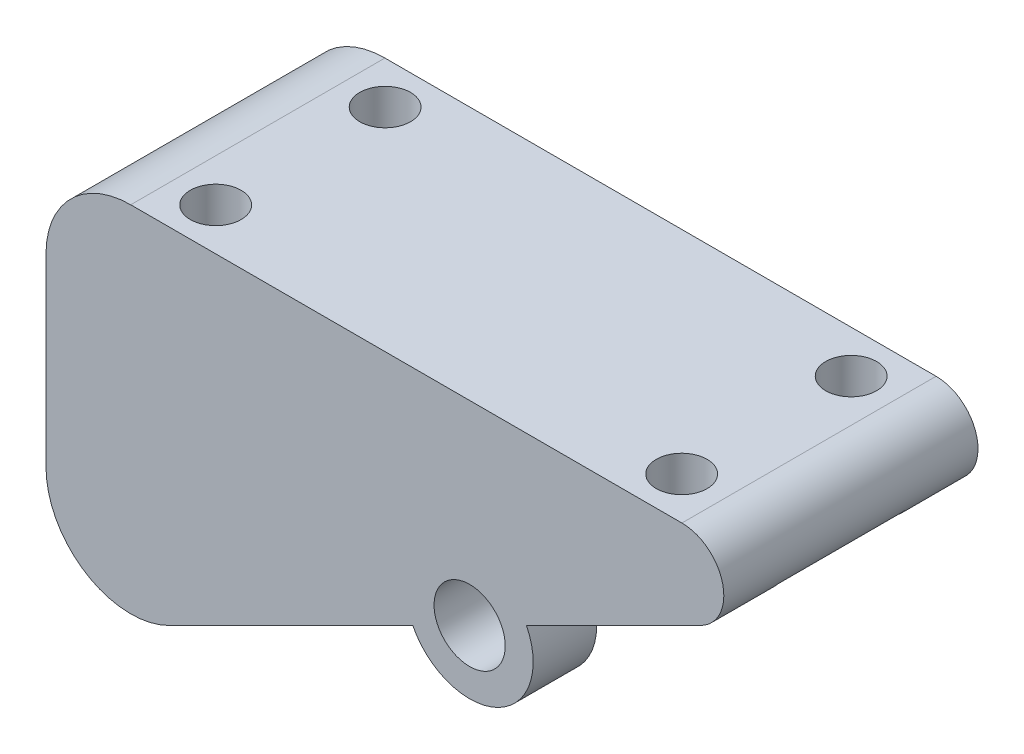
ISO-10303-21;
HEADER;
FILE_DESCRIPTION(('STEP AP214'),'2;1');
FILE_NAME('part.step','',(''),(''),'','','');
FILE_SCHEMA(('AUTOMOTIVE_DESIGN { 1 0 10303 214 1 1 1 1 }'));
ENDSEC;
DATA;
#1=APPLICATION_CONTEXT('core data for automotive mechanical design processes');
#2=APPLICATION_PROTOCOL_DEFINITION('international standard','automotive_design',2000,#1);
#3=PRODUCT_CONTEXT('',#1,'mechanical');
#4=PRODUCT('Part','Part','',(#3));
#5=PRODUCT_RELATED_PRODUCT_CATEGORY('part','',(#4));
#6=PRODUCT_DEFINITION_FORMATION('','',#4);
#7=PRODUCT_DEFINITION_CONTEXT('part definition',#1,'design');
#8=PRODUCT_DEFINITION('design','',#6,#7);
#9=PRODUCT_DEFINITION_SHAPE('','',#8);
#10=(LENGTH_UNIT() NAMED_UNIT(*) SI_UNIT(.MILLI.,.METRE.));
#11=(NAMED_UNIT(*) PLANE_ANGLE_UNIT() SI_UNIT($,.RADIAN.));
#12=(NAMED_UNIT(*) SI_UNIT($,.STERADIAN.) SOLID_ANGLE_UNIT());
#13=UNCERTAINTY_MEASURE_WITH_UNIT(LENGTH_MEASURE(1.E-05),#10,'distance_accuracy_value','');
#14=(GEOMETRIC_REPRESENTATION_CONTEXT(3) GLOBAL_UNCERTAINTY_ASSIGNED_CONTEXT((#13)) GLOBAL_UNIT_ASSIGNED_CONTEXT((#10,
#11,#12)) REPRESENTATION_CONTEXT('',''));
#15=CARTESIAN_POINT('',(0.,0.,0.));
#16=DIRECTION('',(0.,0.,1.));
#17=DIRECTION('',(1.,0.,0.));
#18=AXIS2_PLACEMENT_3D('',#15,#16,#17);
#19=CARTESIAN_POINT('',(-50.,0.,8.));
#20=DIRECTION('',(1.,0.,0.));
#21=DIRECTION('',(0.,1.,0.));
#22=AXIS2_PLACEMENT_3D('',#19,#20,#21);
#23=PLANE('',#22);
#24=DIRECTION('',(0.,-1.,0.));
#25=VECTOR('',#24,1.);
#26=CARTESIAN_POINT('',(-50.,13.0000000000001,-14.5));
#27=LINE('',#26,#25);
#28=CARTESIAN_POINT('',(-50.,13.0000000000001,-14.5));
#29=VERTEX_POINT('',#28);
#30=CARTESIAN_POINT('',(-50.,-8.819660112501,-14.5));
#31=VERTEX_POINT('',#30);
#32=EDGE_CURVE('E67',#29,#31,#27,.T.);
#33=ORIENTED_EDGE('',*,*,#32,.F.);
#34=DIRECTION('',(0.,0.,1.));
#35=VECTOR('',#34,1.);
#36=CARTESIAN_POINT('',(-50.,13.0000000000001,-22.));
#37=LINE('',#36,#35);
#38=CARTESIAN_POINT('',(-50.,13.0000000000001,-22.));
#39=VERTEX_POINT('',#38);
#40=EDGE_CURVE('E177',#29,#39,#37,.F.);
#41=ORIENTED_EDGE('',*,*,#40,.T.);
#42=DIRECTION('',(0.,-1.,0.));
#43=VECTOR('',#42,1.);
#44=CARTESIAN_POINT('',(-50.,23.0000000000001,-22.));
#45=LINE('',#44,#43);
#46=CARTESIAN_POINT('',(-50.,-8.819660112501,-22.));
#47=VERTEX_POINT('',#46);
#48=EDGE_CURVE('E233',#39,#47,#45,.T.);
#49=ORIENTED_EDGE('',*,*,#48,.T.);
#50=DIRECTION('',(0.,0.,1.));
#51=VECTOR('',#50,1.);
#52=CARTESIAN_POINT('',(-50.,-8.819660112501,8.));
#53=LINE('',#52,#51);
#54=EDGE_CURVE('E187',#47,#31,#53,.T.);
#55=ORIENTED_EDGE('',*,*,#54,.T.);
#56=EDGE_LOOP('',(#33,#41,#49,#55));
#57=FACE_BOUND('',#56,.T.);
#58=ADVANCED_FACE('F43',(#57),#23,.F.);
#59=CARTESIAN_POINT('',(0.,0.,-22.));
#60=DIRECTION('',(0.,0.,1.));
#61=DIRECTION('',(1.,0.,0.));
#62=AXIS2_PLACEMENT_3D('',#59,#60,#61);
#63=CYLINDRICAL_SURFACE('',#62,7.5);
#64=CARTESIAN_POINT('',(0.,0.,-14.5));
#65=DIRECTION('',(0.,0.,1.));
#66=DIRECTION('',(1.,0.,0.));
#67=AXIS2_PLACEMENT_3D('',#64,#65,#66);
#68=CIRCLE('',#67,7.5);
#69=CARTESIAN_POINT('',(-6.70820393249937,-3.35410196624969,-14.5));
#70=VERTEX_POINT('',#69);
#71=CARTESIAN_POINT('',(6.70820393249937,3.35410196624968,-14.5));
#72=VERTEX_POINT('',#71);
#73=EDGE_CURVE('E323',#70,#72,#68,.T.);
#74=ORIENTED_EDGE('',*,*,#73,.F.);
#75=DIRECTION('',(0.,0.,1.));
#76=VECTOR('',#75,1.);
#77=CARTESIAN_POINT('',(-6.70820393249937,-3.35410196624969,-22.));
#78=LINE('',#77,#76);
#79=CARTESIAN_POINT('',(-6.70820393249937,-3.35410196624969,-22.));
#80=VERTEX_POINT('',#79);
#81=EDGE_CURVE('E231',#80,#70,#78,.T.);
#82=ORIENTED_EDGE('',*,*,#81,.F.);
#83=CARTESIAN_POINT('',(0.,0.,-22.));
#84=DIRECTION('',(0.,0.,-1.));
#85=DIRECTION('',(-1.,0.,0.));
#86=AXIS2_PLACEMENT_3D('',#83,#84,#85);
#87=CIRCLE('',#86,7.5);
#88=CARTESIAN_POINT('',(6.70820393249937,3.35410196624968,-22.));
#89=VERTEX_POINT('',#88);
#90=EDGE_CURVE('E310',#89,#80,#87,.T.);
#91=ORIENTED_EDGE('',*,*,#90,.F.);
#92=DIRECTION('',(0.,0.,1.));
#93=VECTOR('',#92,1.);
#94=CARTESIAN_POINT('',(6.70820393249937,3.35410196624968,-22.));
#95=LINE('',#94,#93);
#96=EDGE_CURVE('E236',#89,#72,#95,.T.);
#97=ORIENTED_EDGE('',*,*,#96,.T.);
#98=EDGE_LOOP('',(#74,#82,#91,#97));
#99=FACE_BOUND('',#98,.T.);
#100=ADVANCED_FACE('F321',(#99),#63,.T.);
#101=CARTESIAN_POINT('',(-6.70820393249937,-3.35410196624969,-22.));
#102=DIRECTION('',(-0.447213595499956,0.894427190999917,0.));
#103=DIRECTION('',(-0.894427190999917,-0.447213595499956,0.));
#104=AXIS2_PLACEMENT_3D('',#101,#102,#103);
#105=PLANE('',#104);
#106=DIRECTION('',(0.894427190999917,0.447213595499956,0.));
#107=VECTOR('',#106,1.);
#108=CARTESIAN_POINT('',(-35.5278640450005,-17.7639320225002,-14.5));
#109=LINE('',#108,#107);
#110=CARTESIAN_POINT('',(-35.5278640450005,-17.7639320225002,-14.5));
#111=VERTEX_POINT('',#110);
#112=EDGE_CURVE('E273',#111,#70,#109,.T.);
#113=ORIENTED_EDGE('',*,*,#112,.F.);
#114=DIRECTION('',(0.,0.,1.));
#115=VECTOR('',#114,1.);
#116=CARTESIAN_POINT('',(-35.5278640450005,-17.7639320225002,-22.));
#117=LINE('',#116,#115);
#118=CARTESIAN_POINT('',(-35.5278640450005,-17.7639320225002,-22.));
#119=VERTEX_POINT('',#118);
#120=EDGE_CURVE('E190',#111,#119,#117,.F.);
#121=ORIENTED_EDGE('',*,*,#120,.T.);
#122=DIRECTION('',(-0.894427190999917,-0.447213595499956,0.));
#123=VECTOR('',#122,1.);
#124=CARTESIAN_POINT('',(-6.70820393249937,-3.35410196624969,-22.));
#125=LINE('',#124,#123);
#126=EDGE_CURVE('E313',#80,#119,#125,.T.);
#127=ORIENTED_EDGE('',*,*,#126,.F.);
#128=ORIENTED_EDGE('',*,*,#81,.T.);
#129=EDGE_LOOP('',(#113,#121,#127,#128));
#130=FACE_BOUND('',#129,.T.);
#131=ADVANCED_FACE('F386',(#130),#105,.F.);
#132=CARTESIAN_POINT('',(30.,15.0000000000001,-22.));
#133=DIRECTION('',(-0.447213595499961,0.894427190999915,0.));
#134=DIRECTION('',(-0.894427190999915,-0.447213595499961,0.));
#135=AXIS2_PLACEMENT_3D('',#132,#133,#134);
#136=PLANE('',#135);
#137=DIRECTION('',(0.894427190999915,0.447213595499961,0.));
#138=VECTOR('',#137,1.);
#139=CARTESIAN_POINT('',(6.70820393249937,3.35410196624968,-14.5));
#140=LINE('',#139,#138);
#141=CARTESIAN_POINT('',(27.266873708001,13.6334368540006,-14.5));
#142=VERTEX_POINT('',#141);
#143=EDGE_CURVE('E328',#72,#142,#140,.T.);
#144=ORIENTED_EDGE('',*,*,#143,.F.);
#145=ORIENTED_EDGE('',*,*,#96,.F.);
#146=DIRECTION('',(-0.894427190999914,-0.447213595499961,0.));
#147=VECTOR('',#146,1.);
#148=CARTESIAN_POINT('',(30.,15.0000000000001,-22.));
#149=LINE('',#148,#147);
#150=CARTESIAN_POINT('',(27.266873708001,13.6334368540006,-22.));
#151=VERTEX_POINT('',#150);
#152=EDGE_CURVE('E315',#151,#89,#149,.T.);
#153=ORIENTED_EDGE('',*,*,#152,.F.);
#154=DIRECTION('',(0.,0.,-1.));
#155=VECTOR('',#154,1.);
#156=CARTESIAN_POINT('',(27.266873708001,13.6334368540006,-22.));
#157=LINE('',#156,#155);
#158=EDGE_CURVE('E204',#151,#142,#157,.F.);
#159=ORIENTED_EDGE('',*,*,#158,.T.);
#160=EDGE_LOOP('',(#144,#145,#153,#159));
#161=FACE_BOUND('',#160,.T.);
#162=ADVANCED_FACE('F327',(#161),#136,.F.);
#163=CARTESIAN_POINT('',(0.,0.,-22.));
#164=DIRECTION('',(0.,0.,1.));
#165=DIRECTION('',(1.,0.,0.));
#166=AXIS2_PLACEMENT_3D('',#163,#164,#165);
#167=CYLINDRICAL_SURFACE('',#166,4.2);
#168=CARTESIAN_POINT('',(0.,0.,-22.));
#169=DIRECTION('',(0.,0.,-1.));
#170=DIRECTION('',(-1.,0.,0.));
#171=AXIS2_PLACEMENT_3D('',#168,#169,#170);
#172=CIRCLE('',#171,4.2);
#173=CARTESIAN_POINT('',(-4.2,0.,-22.));
#174=VERTEX_POINT('',#173);
#175=EDGE_CURVE('E305',#174,#174,#172,.T.);
#176=ORIENTED_EDGE('',*,*,#175,.T.);
#177=EDGE_LOOP('',(#176));
#178=FACE_BOUND('',#177,.T.);
#179=CARTESIAN_POINT('',(0.,0.,-14.5));
#180=DIRECTION('',(0.,0.,1.));
#181=DIRECTION('',(1.,0.,0.));
#182=AXIS2_PLACEMENT_3D('',#179,#180,#181);
#183=CIRCLE('',#182,4.2);
#184=CARTESIAN_POINT('',(4.2,0.,-14.5));
#185=VERTEX_POINT('',#184);
#186=EDGE_CURVE('E275',#185,#185,#183,.T.);
#187=ORIENTED_EDGE('',*,*,#186,.T.);
#188=EDGE_LOOP('',(#187));
#189=FACE_BOUND('',#188,.T.);
#190=ADVANCED_FACE('F399',(#178,#189),#167,.F.);
#191=CARTESIAN_POINT('',(-40.,-8.819660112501,8.));
#192=DIRECTION('',(0.,0.,1.));
#193=DIRECTION('',(1.,0.,0.));
#194=AXIS2_PLACEMENT_3D('',#191,#192,#193);
#195=CYLINDRICAL_SURFACE('',#194,10.);
#196=ORIENTED_EDGE('',*,*,#120,.F.);
#197=CARTESIAN_POINT('',(-40.,-8.819660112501,-14.5));
#198=DIRECTION('',(0.,0.,1.));
#199=DIRECTION('',(1.,0.,0.));
#200=AXIS2_PLACEMENT_3D('',#197,#198,#199);
#201=CIRCLE('',#200,10.);
#202=EDGE_CURVE('E271',#31,#111,#201,.T.);
#203=ORIENTED_EDGE('',*,*,#202,.F.);
#204=ORIENTED_EDGE('',*,*,#54,.F.);
#205=CARTESIAN_POINT('',(-40.,-8.819660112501,-22.));
#206=DIRECTION('',(0.,0.,1.));
#207=DIRECTION('',(1.,0.,0.));
#208=AXIS2_PLACEMENT_3D('',#205,#206,#207);
#209=CIRCLE('',#208,10.);
#210=EDGE_CURVE('E192',#119,#47,#209,.F.);
#211=ORIENTED_EDGE('',*,*,#210,.F.);
#212=EDGE_LOOP('',(#196,#203,#204,#211));
#213=FACE_BOUND('',#212,.T.);
#214=ADVANCED_FACE('F270',(#213),#195,.T.);
#215=CARTESIAN_POINT('',(25.0557280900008,18.0557280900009,8.));
#216=DIRECTION('',(0.,0.,-1.));
#217=DIRECTION('',(-1.,0.,0.));
#218=AXIS2_PLACEMENT_3D('',#215,#216,#217);
#219=CYLINDRICAL_SURFACE('',#218,4.94427190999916);
#220=CARTESIAN_POINT('',(25.0557280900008,18.0557280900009,0.5));
#221=DIRECTION('',(0.,0.,1.));
#222=DIRECTION('',(1.,0.,0.));
#223=AXIS2_PLACEMENT_3D('',#220,#221,#222);
#224=CIRCLE('',#223,4.94427190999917);
#225=CARTESIAN_POINT('',(27.266873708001,13.6334368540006,0.5));
#226=VERTEX_POINT('',#225);
#227=CARTESIAN_POINT('',(28.942674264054,15.0000000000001,0.5));
#228=VERTEX_POINT('',#227);
#229=EDGE_CURVE('E345',#226,#228,#224,.T.);
#230=ORIENTED_EDGE('',*,*,#229,.T.);
#231=DIRECTION('',(0.,0.,-1.));
#232=VECTOR('',#231,1.);
#233=CARTESIAN_POINT('',(28.942674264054,15.0000000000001,8.));
#234=LINE('',#233,#232);
#235=CARTESIAN_POINT('',(28.942674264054,15.0000000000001,-14.5));
#236=VERTEX_POINT('',#235);
#237=EDGE_CURVE('E207',#236,#228,#234,.F.);
#238=ORIENTED_EDGE('',*,*,#237,.F.);
#239=CARTESIAN_POINT('',(25.0557280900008,18.0557280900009,-14.5));
#240=DIRECTION('',(0.,0.,1.));
#241=DIRECTION('',(1.,0.,0.));
#242=AXIS2_PLACEMENT_3D('',#239,#240,#241);
#243=CIRCLE('',#242,4.94427190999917);
#244=EDGE_CURVE('E331',#142,#236,#243,.T.);
#245=ORIENTED_EDGE('',*,*,#244,.F.);
#246=ORIENTED_EDGE('',*,*,#158,.F.);
#247=CARTESIAN_POINT('',(25.0557280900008,18.0557280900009,-22.));
#248=DIRECTION('',(0.,0.,1.));
#249=DIRECTION('',(1.,0.,0.));
#250=AXIS2_PLACEMENT_3D('',#247,#248,#249);
#251=CIRCLE('',#250,4.94427190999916);
#252=CARTESIAN_POINT('',(25.0557280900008,23.0000000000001,-22.));
#253=VERTEX_POINT('',#252);
#254=EDGE_CURVE('E11',#253,#151,#251,.F.);
#255=ORIENTED_EDGE('',*,*,#254,.F.);
#256=DIRECTION('',(0.,0.,1.));
#257=VECTOR('',#256,1.);
#258=CARTESIAN_POINT('',(25.0557280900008,23.0000000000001,8.));
#259=LINE('',#258,#257);
#260=CARTESIAN_POINT('',(25.0557280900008,23.0000000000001,8.));
#261=VERTEX_POINT('',#260);
#262=EDGE_CURVE('E201',#261,#253,#259,.F.);
#263=ORIENTED_EDGE('',*,*,#262,.F.);
#264=CARTESIAN_POINT('',(25.0557280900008,18.0557280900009,8.));
#265=DIRECTION('',(0.,0.,1.));
#266=DIRECTION('',(1.,0.,0.));
#267=AXIS2_PLACEMENT_3D('',#264,#265,#266);
#268=CIRCLE('',#267,4.94427190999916);
#269=CARTESIAN_POINT('',(27.266873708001,13.6334368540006,8.));
#270=VERTEX_POINT('',#269);
#271=EDGE_CURVE('E52',#270,#261,#268,.T.);
#272=ORIENTED_EDGE('',*,*,#271,.F.);
#273=DIRECTION('',(0.,0.,-1.));
#274=VECTOR('',#273,1.);
#275=CARTESIAN_POINT('',(27.266873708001,13.6334368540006,8.));
#276=LINE('',#275,#274);
#277=EDGE_CURVE('E209',#226,#270,#276,.F.);
#278=ORIENTED_EDGE('',*,*,#277,.F.);
#279=EDGE_LOOP('',(#230,#238,#245,#246,#255,#263,#272,#278));
#280=FACE_BOUND('',#279,.T.);
#281=ADVANCED_FACE('F46',(#280),#219,.T.);
#282=DIRECTION('',(0.,0.,1.));
#283=VECTOR('',#282,1.);
#284=CARTESIAN_POINT('',(-50.,13.0000000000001,-22.));
#285=LINE('',#284,#283);
#286=CARTESIAN_POINT('',(-50.,13.0000000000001,8.));
#287=VERTEX_POINT('',#286);
#288=CARTESIAN_POINT('',(-50.,13.0000000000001,0.5));
#289=VERTEX_POINT('',#288);
#290=EDGE_CURVE('E169',#287,#289,#285,.F.);
#291=ORIENTED_EDGE('',*,*,#290,.T.);
#292=DIRECTION('',(0.,1.,0.));
#293=VECTOR('',#292,1.);
#294=CARTESIAN_POINT('',(-50.,0.,0.5));
#295=LINE('',#294,#293);
#296=CARTESIAN_POINT('',(-50.,-8.819660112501,0.5));
#297=VERTEX_POINT('',#296);
#298=EDGE_CURVE('E155',#297,#289,#295,.T.);
#299=ORIENTED_EDGE('',*,*,#298,.F.);
#300=DIRECTION('',(0.,0.,-1.));
#301=VECTOR('',#300,1.);
#302=CARTESIAN_POINT('',(-50.,-8.819660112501,8.));
#303=LINE('',#302,#301);
#304=CARTESIAN_POINT('',(-50.,-8.819660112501,8.));
#305=VERTEX_POINT('',#304);
#306=EDGE_CURVE('E197',#297,#305,#303,.F.);
#307=ORIENTED_EDGE('',*,*,#306,.T.);
#308=DIRECTION('',(0.,-1.,0.));
#309=VECTOR('',#308,1.);
#310=CARTESIAN_POINT('',(-50.,0.,8.));
#311=LINE('',#310,#309);
#312=EDGE_CURVE('E176',#287,#305,#311,.T.);
#313=ORIENTED_EDGE('',*,*,#312,.F.);
#314=EDGE_LOOP('',(#291,#299,#307,#313));
#315=FACE_BOUND('',#314,.T.);
#316=ADVANCED_FACE('F174',(#315),#23,.F.);
#317=CARTESIAN_POINT('',(0.,15.0000000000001,0.));
#318=DIRECTION('',(0.,1.,0.));
#319=DIRECTION('',(0.,0.,1.));
#320=AXIS2_PLACEMENT_3D('',#317,#318,#319);
#321=PLANE('',#320);
#322=DIRECTION('',(0.,0.,-1.));
#323=VECTOR('',#322,1.);
#324=CARTESIAN_POINT('',(-49.7979589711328,15.0000000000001,0.));
#325=LINE('',#324,#323);
#326=CARTESIAN_POINT('',(-49.7979589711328,15.0000000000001,0.5));
#327=VERTEX_POINT('',#326);
#328=CARTESIAN_POINT('',(-49.7979589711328,15.0000000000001,-14.5));
#329=VERTEX_POINT('',#328);
#330=EDGE_CURVE('E171',#327,#329,#325,.T.);
#331=ORIENTED_EDGE('',*,*,#330,.T.);
#332=DIRECTION('',(-1.,0.,0.));
#333=VECTOR('',#332,1.);
#334=CARTESIAN_POINT('',(28.942674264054,15.0000000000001,-14.5));
#335=LINE('',#334,#333);
#336=EDGE_CURVE('E333',#236,#329,#335,.T.);
#337=ORIENTED_EDGE('',*,*,#336,.F.);
#338=ORIENTED_EDGE('',*,*,#237,.T.);
#339=DIRECTION('',(1.,0.,0.));
#340=VECTOR('',#339,1.);
#341=CARTESIAN_POINT('',(0.,15.0000000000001,0.5));
#342=LINE('',#341,#340);
#343=EDGE_CURVE('E344',#327,#228,#342,.T.);
#344=ORIENTED_EDGE('',*,*,#343,.F.);
#345=EDGE_LOOP('',(#331,#337,#338,#344));
#346=FACE_BOUND('',#345,.T.);
#347=ADVANCED_FACE('F343',(#346),#321,.F.);
#348=CARTESIAN_POINT('',(0.,0.,8.));
#349=DIRECTION('',(-0.447213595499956,0.894427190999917,0.));
#350=DIRECTION('',(-0.894427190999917,-0.447213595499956,0.));
#351=AXIS2_PLACEMENT_3D('',#348,#349,#350);
#352=PLANE('',#351);
#353=DIRECTION('',(0.,0.,-1.));
#354=VECTOR('',#353,1.);
#355=CARTESIAN_POINT('',(-35.5278640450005,-17.7639320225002,8.));
#356=LINE('',#355,#354);
#357=CARTESIAN_POINT('',(-35.5278640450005,-17.7639320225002,8.));
#358=VERTEX_POINT('',#357);
#359=CARTESIAN_POINT('',(-35.5278640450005,-17.7639320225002,0.5));
#360=VERTEX_POINT('',#359);
#361=EDGE_CURVE('E194',#358,#360,#356,.T.);
#362=ORIENTED_EDGE('',*,*,#361,.T.);
#363=DIRECTION('',(-0.894427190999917,-0.447213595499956,0.));
#364=VECTOR('',#363,1.);
#365=CARTESIAN_POINT('',(0.,0.,0.5));
#366=LINE('',#365,#364);
#367=CARTESIAN_POINT('',(-6.70820393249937,-3.35410196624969,0.5));
#368=VERTEX_POINT('',#367);
#369=EDGE_CURVE('E59',#368,#360,#366,.T.);
#370=ORIENTED_EDGE('',*,*,#369,.F.);
#371=DIRECTION('',(0.,0.,-1.));
#372=VECTOR('',#371,1.);
#373=CARTESIAN_POINT('',(-6.70820393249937,-3.35410196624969,8.));
#374=LINE('',#373,#372);
#375=CARTESIAN_POINT('',(-6.70820393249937,-3.35410196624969,8.));
#376=VERTEX_POINT('',#375);
#377=EDGE_CURVE('E254',#376,#368,#374,.T.);
#378=ORIENTED_EDGE('',*,*,#377,.F.);
#379=DIRECTION('',(0.894427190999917,0.447213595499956,0.));
#380=VECTOR('',#379,1.);
#381=CARTESIAN_POINT('',(0.,0.,8.));
#382=LINE('',#381,#380);
#383=EDGE_CURVE('E245',#358,#376,#382,.T.);
#384=ORIENTED_EDGE('',*,*,#383,.F.);
#385=EDGE_LOOP('',(#362,#370,#378,#384));
#386=FACE_BOUND('',#385,.T.);
#387=ADVANCED_FACE('F361',(#386),#352,.F.);
#388=CARTESIAN_POINT('',(0.,0.,8.));
#389=DIRECTION('',(0.,0.,-1.));
#390=DIRECTION('',(-1.,0.,0.));
#391=AXIS2_PLACEMENT_3D('',#388,#389,#390);
#392=CYLINDRICAL_SURFACE('',#391,7.5);
#393=ORIENTED_EDGE('',*,*,#377,.T.);
#394=CARTESIAN_POINT('',(0.,0.,0.5));
#395=DIRECTION('',(0.,0.,1.));
#396=DIRECTION('',(1.,0.,0.));
#397=AXIS2_PLACEMENT_3D('',#394,#395,#396);
#398=CIRCLE('',#397,7.5);
#399=CARTESIAN_POINT('',(6.70820393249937,3.35410196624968,0.5));
#400=VERTEX_POINT('',#399);
#401=EDGE_CURVE('E352',#368,#400,#398,.T.);
#402=ORIENTED_EDGE('',*,*,#401,.T.);
#403=DIRECTION('',(0.,0.,-1.));
#404=VECTOR('',#403,1.);
#405=CARTESIAN_POINT('',(6.70820393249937,3.35410196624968,8.));
#406=LINE('',#405,#404);
#407=CARTESIAN_POINT('',(6.70820393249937,3.35410196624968,8.));
#408=VERTEX_POINT('',#407);
#409=EDGE_CURVE('E251',#408,#400,#406,.T.);
#410=ORIENTED_EDGE('',*,*,#409,.F.);
#411=CARTESIAN_POINT('',(0.,0.,8.));
#412=DIRECTION('',(0.,0.,1.));
#413=DIRECTION('',(1.,0.,0.));
#414=AXIS2_PLACEMENT_3D('',#411,#412,#413);
#415=CIRCLE('',#414,7.5);
#416=EDGE_CURVE('E247',#376,#408,#415,.T.);
#417=ORIENTED_EDGE('',*,*,#416,.F.);
#418=EDGE_LOOP('',(#393,#402,#410,#417));
#419=FACE_BOUND('',#418,.T.);
#420=ADVANCED_FACE('F366',(#419),#392,.T.);
#421=CARTESIAN_POINT('',(0.,0.,8.));
#422=DIRECTION('',(-0.447213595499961,0.894427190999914,0.));
#423=DIRECTION('',(-0.894427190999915,-0.447213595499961,0.));
#424=AXIS2_PLACEMENT_3D('',#421,#422,#423);
#425=PLANE('',#424);
#426=ORIENTED_EDGE('',*,*,#409,.T.);
#427=DIRECTION('',(-0.894427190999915,-0.447213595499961,0.));
#428=VECTOR('',#427,1.);
#429=CARTESIAN_POINT('',(0.,0.,0.5));
#430=LINE('',#429,#428);
#431=EDGE_CURVE('E348',#226,#400,#430,.T.);
#432=ORIENTED_EDGE('',*,*,#431,.F.);
#433=ORIENTED_EDGE('',*,*,#277,.T.);
#434=DIRECTION('',(0.894427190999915,0.447213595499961,0.));
#435=VECTOR('',#434,1.);
#436=CARTESIAN_POINT('',(0.,0.,8.));
#437=LINE('',#436,#435);
#438=EDGE_CURVE('E219',#408,#270,#437,.T.);
#439=ORIENTED_EDGE('',*,*,#438,.F.);
#440=EDGE_LOOP('',(#426,#432,#433,#439));
#441=FACE_BOUND('',#440,.T.);
#442=ADVANCED_FACE('F369',(#441),#425,.F.);
#443=CARTESIAN_POINT('',(0.,0.,8.));
#444=DIRECTION('',(0.,0.,-1.));
#445=DIRECTION('',(-1.,0.,0.));
#446=AXIS2_PLACEMENT_3D('',#443,#444,#445);
#447=CYLINDRICAL_SURFACE('',#446,4.2);
#448=CARTESIAN_POINT('',(0.,0.,0.5));
#449=DIRECTION('',(0.,0.,1.));
#450=DIRECTION('',(1.,0.,0.));
#451=AXIS2_PLACEMENT_3D('',#448,#449,#450);
#452=CIRCLE('',#451,4.2);
#453=CARTESIAN_POINT('',(4.2,0.,0.5));
#454=VERTEX_POINT('',#453);
#455=EDGE_CURVE('E335',#454,#454,#452,.T.);
#456=ORIENTED_EDGE('',*,*,#455,.F.);
#457=EDGE_LOOP('',(#456));
#458=FACE_BOUND('',#457,.T.);
#459=CARTESIAN_POINT('',(0.,0.,8.));
#460=DIRECTION('',(0.,0.,1.));
#461=DIRECTION('',(1.,0.,0.));
#462=AXIS2_PLACEMENT_3D('',#459,#460,#461);
#463=CIRCLE('',#462,4.2);
#464=CARTESIAN_POINT('',(4.2,0.,8.));
#465=VERTEX_POINT('',#464);
#466=EDGE_CURVE('E242',#465,#465,#463,.T.);
#467=ORIENTED_EDGE('',*,*,#466,.T.);
#468=EDGE_LOOP('',(#467));
#469=FACE_BOUND('',#468,.T.);
#470=ADVANCED_FACE('F371',(#458,#469),#447,.F.);
#471=CARTESIAN_POINT('',(0.,0.,8.));
#472=DIRECTION('',(0.,0.,1.));
#473=DIRECTION('',(1.,0.,0.));
#474=AXIS2_PLACEMENT_3D('',#471,#472,#473);
#475=PLANE('',#474);
#476=ORIENTED_EDGE('',*,*,#466,.F.);
#477=EDGE_LOOP('',(#476));
#478=FACE_BOUND('',#477,.T.);
#479=ORIENTED_EDGE('',*,*,#438,.T.);
#480=ORIENTED_EDGE('',*,*,#271,.T.);
#481=DIRECTION('',(1.,0.,0.));
#482=VECTOR('',#481,1.);
#483=CARTESIAN_POINT('',(-50.,23.0000000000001,8.));
#484=LINE('',#483,#482);
#485=CARTESIAN_POINT('',(-40.,23.0000000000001,8.));
#486=VERTEX_POINT('',#485);
#487=EDGE_CURVE('E217',#486,#261,#484,.T.);
#488=ORIENTED_EDGE('',*,*,#487,.F.);
#489=CARTESIAN_POINT('',(-40.,13.0000000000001,8.));
#490=DIRECTION('',(0.,0.,1.));
#491=DIRECTION('',(1.,0.,0.));
#492=AXIS2_PLACEMENT_3D('',#489,#490,#491);
#493=CIRCLE('',#492,10.);
#494=EDGE_CURVE('E181',#486,#287,#493,.T.);
#495=ORIENTED_EDGE('',*,*,#494,.T.);
#496=ORIENTED_EDGE('',*,*,#312,.T.);
#497=CARTESIAN_POINT('',(-40.,-8.819660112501,8.));
#498=DIRECTION('',(0.,0.,1.));
#499=DIRECTION('',(1.,0.,0.));
#500=AXIS2_PLACEMENT_3D('',#497,#498,#499);
#501=CIRCLE('',#500,10.);
#502=EDGE_CURVE('E199',#305,#358,#501,.T.);
#503=ORIENTED_EDGE('',*,*,#502,.T.);
#504=ORIENTED_EDGE('',*,*,#383,.T.);
#505=ORIENTED_EDGE('',*,*,#416,.T.);
#506=EDGE_LOOP('',(#479,#480,#488,#495,#496,#503,#504,#505));
#507=FACE_BOUND('',#506,.T.);
#508=ADVANCED_FACE('F215',(#478,#507),#475,.T.);
#509=CARTESIAN_POINT('',(-50.,23.0000000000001,-22.));
#510=DIRECTION('',(0.,0.,1.));
#511=DIRECTION('',(1.,0.,0.));
#512=AXIS2_PLACEMENT_3D('',#509,#510,#511);
#513=PLANE('',#512);
#514=DIRECTION('',(-1.,0.,0.));
#515=VECTOR('',#514,1.);
#516=CARTESIAN_POINT('',(-50.,23.0000000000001,-22.));
#517=LINE('',#516,#515);
#518=CARTESIAN_POINT('',(-40.,23.0000000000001,-22.));
#519=VERTEX_POINT('',#518);
#520=EDGE_CURVE('E230',#253,#519,#517,.T.);
#521=ORIENTED_EDGE('',*,*,#520,.F.);
#522=ORIENTED_EDGE('',*,*,#254,.T.);
#523=ORIENTED_EDGE('',*,*,#152,.T.);
#524=ORIENTED_EDGE('',*,*,#90,.T.);
#525=ORIENTED_EDGE('',*,*,#126,.T.);
#526=ORIENTED_EDGE('',*,*,#210,.T.);
#527=ORIENTED_EDGE('',*,*,#48,.F.);
#528=CARTESIAN_POINT('',(-40.,13.0000000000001,-22.));
#529=DIRECTION('',(0.,0.,1.));
#530=DIRECTION('',(1.,0.,0.));
#531=AXIS2_PLACEMENT_3D('',#528,#529,#530);
#532=CIRCLE('',#531,10.);
#533=EDGE_CURVE('E179',#39,#519,#532,.F.);
#534=ORIENTED_EDGE('',*,*,#533,.T.);
#535=EDGE_LOOP('',(#521,#522,#523,#524,#525,#526,#527,#534));
#536=FACE_BOUND('',#535,.T.);
#537=ORIENTED_EDGE('',*,*,#175,.F.);
#538=EDGE_LOOP('',(#537));
#539=FACE_BOUND('',#538,.T.);
#540=ADVANCED_FACE('F262',(#536,#539),#513,.F.);
#541=CARTESIAN_POINT('',(0.,23.0000000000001,0.));
#542=DIRECTION('',(0.,1.,0.));
#543=DIRECTION('',(0.,0.,1.));
#544=AXIS2_PLACEMENT_3D('',#541,#542,#543);
#545=PLANE('',#544);
#546=CARTESIAN_POINT('',(-34.9721359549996,23.0000000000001,-17.));
#547=DIRECTION('',(0.,1.,0.));
#548=DIRECTION('',(0.,0.,-1.));
#549=AXIS2_PLACEMENT_3D('',#546,#547,#548);
#550=CIRCLE('',#549,3.);
#551=CARTESIAN_POINT('',(-34.9721359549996,23.0000000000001,-20.));
#552=VERTEX_POINT('',#551);
#553=EDGE_CURVE('E297',#552,#552,#550,.T.);
#554=ORIENTED_EDGE('',*,*,#553,.F.);
#555=EDGE_LOOP('',(#554));
#556=FACE_BOUND('',#555,.T.);
#557=CARTESIAN_POINT('',(20.0278640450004,23.0000000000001,-17.));
#558=DIRECTION('',(0.,1.,0.));
#559=DIRECTION('',(0.,0.,1.));
#560=AXIS2_PLACEMENT_3D('',#557,#558,#559);
#561=CIRCLE('',#560,3.);
#562=CARTESIAN_POINT('',(20.0278640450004,23.0000000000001,-14.));
#563=VERTEX_POINT('',#562);
#564=EDGE_CURVE('E291',#563,#563,#561,.T.);
#565=ORIENTED_EDGE('',*,*,#564,.F.);
#566=EDGE_LOOP('',(#565));
#567=FACE_BOUND('',#566,.T.);
#568=CARTESIAN_POINT('',(20.0278640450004,23.0000000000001,3.));
#569=DIRECTION('',(0.,1.,0.));
#570=DIRECTION('',(0.,0.,-1.));
#571=AXIS2_PLACEMENT_3D('',#568,#569,#570);
#572=CIRCLE('',#571,3.);
#573=CARTESIAN_POINT('',(20.0278640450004,23.0000000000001,0.));
#574=VERTEX_POINT('',#573);
#575=EDGE_CURVE('E284',#574,#574,#572,.T.);
#576=ORIENTED_EDGE('',*,*,#575,.F.);
#577=EDGE_LOOP('',(#576));
#578=FACE_BOUND('',#577,.T.);
#579=CARTESIAN_POINT('',(-34.9721359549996,23.0000000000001,3.));
#580=DIRECTION('',(0.,1.,0.));
#581=DIRECTION('',(0.,0.,1.));
#582=AXIS2_PLACEMENT_3D('',#579,#580,#581);
#583=CIRCLE('',#582,3.);
#584=CARTESIAN_POINT('',(-34.9721359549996,23.0000000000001,6.));
#585=VERTEX_POINT('',#584);
#586=EDGE_CURVE('E287',#585,#585,#583,.T.);
#587=ORIENTED_EDGE('',*,*,#586,.F.);
#588=EDGE_LOOP('',(#587));
#589=FACE_BOUND('',#588,.T.);
#590=ORIENTED_EDGE('',*,*,#487,.T.);
#591=ORIENTED_EDGE('',*,*,#262,.T.);
#592=ORIENTED_EDGE('',*,*,#520,.T.);
#593=DIRECTION('',(0.,0.,1.));
#594=VECTOR('',#593,1.);
#595=CARTESIAN_POINT('',(-40.,23.0000000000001,8.));
#596=LINE('',#595,#594);
#597=EDGE_CURVE('E229',#519,#486,#596,.T.);
#598=ORIENTED_EDGE('',*,*,#597,.T.);
#599=EDGE_LOOP('',(#590,#591,#592,#598));
#600=FACE_BOUND('',#599,.T.);
#601=ADVANCED_FACE('F227',(#556,#567,#578,#589,#600),#545,.T.);
#602=CARTESIAN_POINT('',(-40.,13.0000000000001,0.));
#603=DIRECTION('',(0.,0.,-1.));
#604=DIRECTION('',(-1.,0.,0.));
#605=AXIS2_PLACEMENT_3D('',#602,#603,#604);
#606=CYLINDRICAL_SURFACE('',#605,10.);
#607=ORIENTED_EDGE('',*,*,#330,.F.);
#608=CARTESIAN_POINT('',(-40.,13.0000000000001,0.5));
#609=DIRECTION('',(0.,0.,1.));
#610=DIRECTION('',(1.,0.,0.));
#611=AXIS2_PLACEMENT_3D('',#608,#609,#610);
#612=CIRCLE('',#611,10.);
#613=EDGE_CURVE('E159',#327,#289,#612,.T.);
#614=ORIENTED_EDGE('',*,*,#613,.T.);
#615=ORIENTED_EDGE('',*,*,#290,.F.);
#616=ORIENTED_EDGE('',*,*,#494,.F.);
#617=ORIENTED_EDGE('',*,*,#597,.F.);
#618=ORIENTED_EDGE('',*,*,#533,.F.);
#619=ORIENTED_EDGE('',*,*,#40,.F.);
#620=CARTESIAN_POINT('',(-40.,13.0000000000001,-14.5));
#621=DIRECTION('',(0.,0.,1.));
#622=DIRECTION('',(1.,0.,0.));
#623=AXIS2_PLACEMENT_3D('',#620,#621,#622);
#624=CIRCLE('',#623,10.);
#625=EDGE_CURVE('E277',#329,#29,#624,.T.);
#626=ORIENTED_EDGE('',*,*,#625,.F.);
#627=EDGE_LOOP('',(#607,#614,#615,#616,#617,#618,#619,#626));
#628=FACE_BOUND('',#627,.T.);
#629=ADVANCED_FACE('F168',(#628),#606,.T.);
#630=CARTESIAN_POINT('',(-40.,-8.819660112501,8.));
#631=DIRECTION('',(0.,0.,-1.));
#632=DIRECTION('',(-1.,0.,0.));
#633=AXIS2_PLACEMENT_3D('',#630,#631,#632);
#634=CYLINDRICAL_SURFACE('',#633,10.);
#635=CARTESIAN_POINT('',(-40.,-8.819660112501,0.5));
#636=DIRECTION('',(0.,0.,1.));
#637=DIRECTION('',(1.,0.,0.));
#638=AXIS2_PLACEMENT_3D('',#635,#636,#637);
#639=CIRCLE('',#638,10.);
#640=EDGE_CURVE('E161',#297,#360,#639,.T.);
#641=ORIENTED_EDGE('',*,*,#640,.T.);
#642=ORIENTED_EDGE('',*,*,#361,.F.);
#643=ORIENTED_EDGE('',*,*,#502,.F.);
#644=ORIENTED_EDGE('',*,*,#306,.F.);
#645=EDGE_LOOP('',(#641,#642,#643,#644));
#646=FACE_BOUND('',#645,.T.);
#647=ADVANCED_FACE('F358',(#646),#634,.T.);
#648=CARTESIAN_POINT('',(-34.9721359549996,17.0000000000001,3.));
#649=DIRECTION('',(0.,1.,0.));
#650=DIRECTION('',(0.,0.,1.));
#651=AXIS2_PLACEMENT_3D('',#648,#649,#650);
#652=CYLINDRICAL_SURFACE('',#651,3.);
#653=CARTESIAN_POINT('',(-34.9721359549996,17.0000000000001,3.));
#654=DIRECTION('',(0.,1.,0.));
#655=DIRECTION('',(0.,0.,1.));
#656=AXIS2_PLACEMENT_3D('',#653,#654,#655);
#657=CIRCLE('',#656,3.);
#658=CARTESIAN_POINT('',(-34.9721359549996,17.0000000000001,6.));
#659=VERTEX_POINT('',#658);
#660=EDGE_CURVE('E302',#659,#659,#657,.T.);
#661=ORIENTED_EDGE('',*,*,#660,.F.);
#662=EDGE_LOOP('',(#661));
#663=FACE_BOUND('',#662,.T.);
#664=ORIENTED_EDGE('',*,*,#586,.T.);
#665=EDGE_LOOP('',(#664));
#666=FACE_BOUND('',#665,.T.);
#667=ADVANCED_FACE('F408',(#663,#666),#652,.F.);
#668=CARTESIAN_POINT('',(-34.9721359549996,17.0000000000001,3.));
#669=DIRECTION('',(0.,1.,0.));
#670=DIRECTION('',(0.,0.,1.));
#671=AXIS2_PLACEMENT_3D('',#668,#669,#670);
#672=PLANE('',#671);
#673=ORIENTED_EDGE('',*,*,#660,.T.);
#674=EDGE_LOOP('',(#673));
#675=FACE_BOUND('',#674,.T.);
#676=ADVANCED_FACE('F414',(#675),#672,.T.);
#677=CARTESIAN_POINT('',(20.0278640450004,17.0000000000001,3.));
#678=DIRECTION('',(0.,1.,0.));
#679=DIRECTION('',(0.,0.,1.));
#680=AXIS2_PLACEMENT_3D('',#677,#678,#679);
#681=CYLINDRICAL_SURFACE('',#680,3.);
#682=CARTESIAN_POINT('',(20.0278640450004,17.0000000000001,3.));
#683=DIRECTION('',(0.,1.,0.));
#684=DIRECTION('',(0.,0.,-1.));
#685=AXIS2_PLACEMENT_3D('',#682,#683,#684);
#686=CIRCLE('',#685,3.);
#687=CARTESIAN_POINT('',(20.0278640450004,17.0000000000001,0.));
#688=VERTEX_POINT('',#687);
#689=EDGE_CURVE('E288',#688,#688,#686,.T.);
#690=ORIENTED_EDGE('',*,*,#689,.F.);
#691=EDGE_LOOP('',(#690));
#692=FACE_BOUND('',#691,.T.);
#693=ORIENTED_EDGE('',*,*,#575,.T.);
#694=EDGE_LOOP('',(#693));
#695=FACE_BOUND('',#694,.T.);
#696=ADVANCED_FACE('F484',(#692,#695),#681,.F.);
#697=CARTESIAN_POINT('',(20.0278640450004,17.0000000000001,3.));
#698=DIRECTION('',(0.,-1.,0.));
#699=DIRECTION('',(0.,0.,-1.));
#700=AXIS2_PLACEMENT_3D('',#697,#698,#699);
#701=PLANE('',#700);
#702=ORIENTED_EDGE('',*,*,#689,.T.);
#703=EDGE_LOOP('',(#702));
#704=FACE_BOUND('',#703,.T.);
#705=ADVANCED_FACE('F494',(#704),#701,.F.);
#706=CARTESIAN_POINT('',(20.0278640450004,17.0000000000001,-17.));
#707=DIRECTION('',(0.,1.,0.));
#708=DIRECTION('',(0.,0.,1.));
#709=AXIS2_PLACEMENT_3D('',#706,#707,#708);
#710=CYLINDRICAL_SURFACE('',#709,3.);
#711=CARTESIAN_POINT('',(20.0278640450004,17.0000000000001,-17.));
#712=DIRECTION('',(0.,1.,0.));
#713=DIRECTION('',(0.,0.,1.));
#714=AXIS2_PLACEMENT_3D('',#711,#712,#713);
#715=CIRCLE('',#714,3.);
#716=CARTESIAN_POINT('',(20.0278640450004,17.0000000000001,-14.));
#717=VERTEX_POINT('',#716);
#718=EDGE_CURVE('E294',#717,#717,#715,.T.);
#719=ORIENTED_EDGE('',*,*,#718,.F.);
#720=EDGE_LOOP('',(#719));
#721=FACE_BOUND('',#720,.T.);
#722=ORIENTED_EDGE('',*,*,#564,.T.);
#723=EDGE_LOOP('',(#722));
#724=FACE_BOUND('',#723,.T.);
#725=ADVANCED_FACE('F504',(#721,#724),#710,.F.);
#726=CARTESIAN_POINT('',(20.0278640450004,17.0000000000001,-17.));
#727=DIRECTION('',(0.,1.,0.));
#728=DIRECTION('',(0.,0.,1.));
#729=AXIS2_PLACEMENT_3D('',#726,#727,#728);
#730=PLANE('',#729);
#731=ORIENTED_EDGE('',*,*,#718,.T.);
#732=EDGE_LOOP('',(#731));
#733=FACE_BOUND('',#732,.T.);
#734=ADVANCED_FACE('F514',(#733),#730,.T.);
#735=CARTESIAN_POINT('',(-34.9721359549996,17.0000000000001,-17.));
#736=DIRECTION('',(0.,1.,0.));
#737=DIRECTION('',(0.,0.,1.));
#738=AXIS2_PLACEMENT_3D('',#735,#736,#737);
#739=CYLINDRICAL_SURFACE('',#738,3.);
#740=CARTESIAN_POINT('',(-34.9721359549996,17.0000000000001,-17.));
#741=DIRECTION('',(0.,1.,0.));
#742=DIRECTION('',(0.,0.,-1.));
#743=AXIS2_PLACEMENT_3D('',#740,#741,#742);
#744=CIRCLE('',#743,3.);
#745=CARTESIAN_POINT('',(-34.9721359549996,17.0000000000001,-20.));
#746=VERTEX_POINT('',#745);
#747=EDGE_CURVE('E283',#746,#746,#744,.T.);
#748=ORIENTED_EDGE('',*,*,#747,.F.);
#749=EDGE_LOOP('',(#748));
#750=FACE_BOUND('',#749,.T.);
#751=ORIENTED_EDGE('',*,*,#553,.T.);
#752=EDGE_LOOP('',(#751));
#753=FACE_BOUND('',#752,.T.);
#754=ADVANCED_FACE('F524',(#750,#753),#739,.F.);
#755=CARTESIAN_POINT('',(-34.9721359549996,17.0000000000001,-17.));
#756=DIRECTION('',(0.,-1.,0.));
#757=DIRECTION('',(0.,0.,-1.));
#758=AXIS2_PLACEMENT_3D('',#755,#756,#757);
#759=PLANE('',#758);
#760=ORIENTED_EDGE('',*,*,#747,.T.);
#761=EDGE_LOOP('',(#760));
#762=FACE_BOUND('',#761,.T.);
#763=ADVANCED_FACE('F534',(#762),#759,.F.);
#764=CARTESIAN_POINT('',(0.,0.,-14.5));
#765=DIRECTION('',(0.,0.,1.));
#766=DIRECTION('',(1.,0.,0.));
#767=AXIS2_PLACEMENT_3D('',#764,#765,#766);
#768=PLANE('',#767);
#769=ORIENTED_EDGE('',*,*,#186,.F.);
#770=EDGE_LOOP('',(#769));
#771=FACE_BOUND('',#770,.T.);
#772=ORIENTED_EDGE('',*,*,#73,.T.);
#773=ORIENTED_EDGE('',*,*,#143,.T.);
#774=ORIENTED_EDGE('',*,*,#244,.T.);
#775=ORIENTED_EDGE('',*,*,#336,.T.);
#776=ORIENTED_EDGE('',*,*,#625,.T.);
#777=ORIENTED_EDGE('',*,*,#32,.T.);
#778=ORIENTED_EDGE('',*,*,#202,.T.);
#779=ORIENTED_EDGE('',*,*,#112,.T.);
#780=EDGE_LOOP('',(#772,#773,#774,#775,#776,#777,#778,#779));
#781=FACE_BOUND('',#780,.T.);
#782=ADVANCED_FACE('F340',(#771,#781),#768,.T.);
#783=CARTESIAN_POINT('',(-40.,13.0000000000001,0.5));
#784=DIRECTION('',(0.,0.,1.));
#785=DIRECTION('',(1.,0.,0.));
#786=AXIS2_PLACEMENT_3D('',#783,#784,#785);
#787=PLANE('',#786);
#788=ORIENTED_EDGE('',*,*,#455,.T.);
#789=EDGE_LOOP('',(#788));
#790=FACE_BOUND('',#789,.T.);
#791=ORIENTED_EDGE('',*,*,#613,.F.);
#792=ORIENTED_EDGE('',*,*,#343,.T.);
#793=ORIENTED_EDGE('',*,*,#229,.F.);
#794=ORIENTED_EDGE('',*,*,#431,.T.);
#795=ORIENTED_EDGE('',*,*,#401,.F.);
#796=ORIENTED_EDGE('',*,*,#369,.T.);
#797=ORIENTED_EDGE('',*,*,#640,.F.);
#798=ORIENTED_EDGE('',*,*,#298,.T.);
#799=EDGE_LOOP('',(#791,#792,#793,#794,#795,#796,#797,#798));
#800=FACE_BOUND('',#799,.T.);
#801=ADVANCED_FACE('F157',(#790,#800),#787,.F.);
#802=CLOSED_SHELL('',(#58,#100,#131,#162,#190,#214,#281,#316,#347,#387,#420,#442,#470,#508,#540,
#601,#629,#647,#667,#676,#696,#705,#725,#734,#754,#763,#782,#801));
#803=MANIFOLD_SOLID_BREP('B2',#802);
#804=ADVANCED_BREP_SHAPE_REPRESENTATION('',(#18,#803),#14);
#805=SHAPE_DEFINITION_REPRESENTATION(#9,#804);
ENDSEC;
END-ISO-10303-21;
